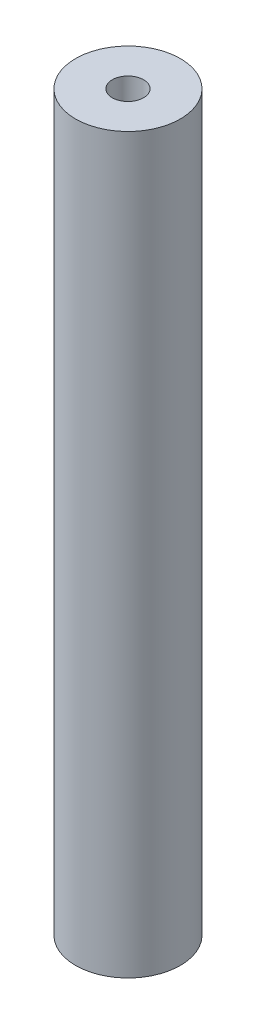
from build123d import *

# Parameters (mm, degrees)
SKETCH1_R                   = 6.35
BOSS_EXTRUDE1_DEPTH         = 88.9
F_10_24_TAPPED_HOLE2_D      = 3.7973
F_10_24_TAPPED_HOLE2_DEPTH  = 14.986
F_10_24_TAPPED_HOLE2_TIP    = 1.140824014
F_1_4_20_TAPPED_HOLE1_D     = 5.1054
F_1_4_20_TAPPED_HOLE1_DEPTH = 19.05
F_1_4_20_TAPPED_HOLE1_TIP   = 1.533816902


with BuildPart() as part:
    # Sketch1 → Boss-Extrude1 (new body)
    with BuildSketch(Plane(origin=(0, 0, 0), x_dir=(1, 0, 0), z_dir=(0, 1, 0))):
        with Locations(Location((0, 0, 0), (0, 0, 270))):
            Circle(SKETCH1_R)
    extrude(amount=BOSS_EXTRUDE1_DEPTH)

    # 10-24 Tapped Hole2
    with Locations(Plane(origin=(0, 88.9, 0), x_dir=(1, 0, 0), z_dir=(0, 1, 0))):
        with Locations((0, 0)):
            Hole(F_10_24_TAPPED_HOLE2_D / 2, depth=F_10_24_TAPPED_HOLE2_DEPTH)
            with Locations((0, 0, -(F_10_24_TAPPED_HOLE2_DEPTH + F_10_24_TAPPED_HOLE2_TIP / 2))):  # 118° drill point
                Cone(0, F_10_24_TAPPED_HOLE2_D / 2, F_10_24_TAPPED_HOLE2_TIP, mode=Mode.SUBTRACT)

    # 1_4-20 Tapped Hole1
    with Locations(Plane(origin=(0, 0, 0), x_dir=(-1, 0, 0), z_dir=(0, -1, 0))):
        with Locations((0, 0)):
            Hole(F_1_4_20_TAPPED_HOLE1_D / 2, depth=F_1_4_20_TAPPED_HOLE1_DEPTH)
            with Locations((0, 0, -(F_1_4_20_TAPPED_HOLE1_DEPTH + F_1_4_20_TAPPED_HOLE1_TIP / 2))):  # 118° drill point
                Cone(0, F_1_4_20_TAPPED_HOLE1_D / 2, F_1_4_20_TAPPED_HOLE1_TIP, mode=Mode.SUBTRACT)


solid = part.part
